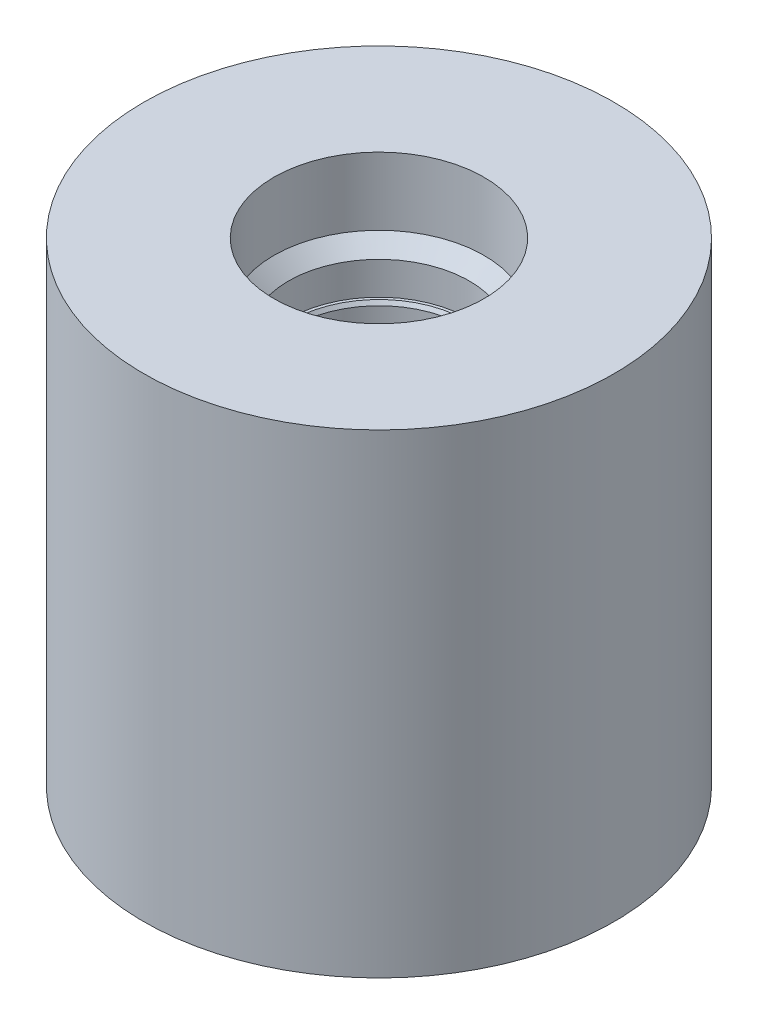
ISO-10303-21;
HEADER;
FILE_DESCRIPTION(('STEP AP214'),'2;1');
FILE_NAME('part.step','',(''),(''),'','','');
FILE_SCHEMA(('AUTOMOTIVE_DESIGN { 1 0 10303 214 1 1 1 1 }'));
ENDSEC;
DATA;
#1=APPLICATION_CONTEXT('core data for automotive mechanical design processes');
#2=APPLICATION_PROTOCOL_DEFINITION('international standard','automotive_design',2000,#1);
#3=PRODUCT_CONTEXT('',#1,'mechanical');
#4=PRODUCT('Part','Part','',(#3));
#5=PRODUCT_RELATED_PRODUCT_CATEGORY('part','',(#4));
#6=PRODUCT_DEFINITION_FORMATION('','',#4);
#7=PRODUCT_DEFINITION_CONTEXT('part definition',#1,'design');
#8=PRODUCT_DEFINITION('design','',#6,#7);
#9=PRODUCT_DEFINITION_SHAPE('','',#8);
#10=(LENGTH_UNIT() NAMED_UNIT(*) SI_UNIT(.MILLI.,.METRE.));
#11=(NAMED_UNIT(*) PLANE_ANGLE_UNIT() SI_UNIT($,.RADIAN.));
#12=(NAMED_UNIT(*) SI_UNIT($,.STERADIAN.) SOLID_ANGLE_UNIT());
#13=UNCERTAINTY_MEASURE_WITH_UNIT(LENGTH_MEASURE(1.E-05),#10,'distance_accuracy_value','');
#14=(GEOMETRIC_REPRESENTATION_CONTEXT(3) GLOBAL_UNCERTAINTY_ASSIGNED_CONTEXT((#13)) GLOBAL_UNIT_ASSIGNED_CONTEXT((#10,
#11,#12)) REPRESENTATION_CONTEXT('',''));
#15=CARTESIAN_POINT('',(0.,0.,0.));
#16=DIRECTION('',(0.,0.,1.));
#17=DIRECTION('',(1.,0.,0.));
#18=AXIS2_PLACEMENT_3D('',#15,#16,#17);
#19=CARTESIAN_POINT('',(12.0466226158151,653.036002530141,0.));
#20=DIRECTION('',(0.,1.,0.));
#21=DIRECTION('',(-1.,0.,0.));
#22=AXIS2_PLACEMENT_3D('',#19,#20,#21);
#23=CYLINDRICAL_SURFACE('',#22,28.3989476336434);
#24=CARTESIAN_POINT('',(12.0466226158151,595.722591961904,0.));
#25=DIRECTION('',(0.,1.,0.));
#26=DIRECTION('',(-1.,0.,0.));
#27=AXIS2_PLACEMENT_3D('',#24,#25,#26);
#28=CIRCLE('',#27,28.3989476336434);
#29=CARTESIAN_POINT('',(-16.3523250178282,595.722591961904,0.));
#30=VERTEX_POINT('',#29);
#31=EDGE_CURVE('E10',#30,#30,#28,.T.);
#32=ORIENTED_EDGE('',*,*,#31,.T.);
#33=EDGE_LOOP('',(#32));
#34=FACE_BOUND('',#33,.T.);
#35=CARTESIAN_POINT('',(12.0466226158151,653.036002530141,0.));
#36=DIRECTION('',(0.,1.,0.));
#37=DIRECTION('',(-1.,0.,0.));
#38=AXIS2_PLACEMENT_3D('',#35,#36,#37);
#39=CIRCLE('',#38,28.3989476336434);
#40=CARTESIAN_POINT('',(-16.3523250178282,653.036002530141,0.));
#41=VERTEX_POINT('',#40);
#42=EDGE_CURVE('E76',#41,#41,#39,.T.);
#43=ORIENTED_EDGE('',*,*,#42,.F.);
#44=EDGE_LOOP('',(#43));
#45=FACE_BOUND('',#44,.T.);
#46=ADVANCED_FACE('F24',(#34,#45),#23,.T.);
#47=CARTESIAN_POINT('',(-16.3523250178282,595.722591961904,0.));
#48=DIRECTION('',(0.,-1.,0.));
#49=DIRECTION('',(1.,0.,0.));
#50=AXIS2_PLACEMENT_3D('',#47,#48,#49);
#51=PLANE('',#50);
#52=CARTESIAN_POINT('',(12.0466226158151,595.722591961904,0.));
#53=DIRECTION('',(0.,1.,0.));
#54=DIRECTION('',(-1.,0.,0.));
#55=AXIS2_PLACEMENT_3D('',#52,#53,#54);
#56=CIRCLE('',#55,6.745);
#57=CARTESIAN_POINT('',(5.30162261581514,595.722591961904,0.));
#58=VERTEX_POINT('',#57);
#59=EDGE_CURVE('E30',#58,#58,#56,.T.);
#60=ORIENTED_EDGE('',*,*,#59,.T.);
#61=EDGE_LOOP('',(#60));
#62=FACE_BOUND('',#61,.T.);
#63=ORIENTED_EDGE('',*,*,#31,.F.);
#64=EDGE_LOOP('',(#63));
#65=FACE_BOUND('',#64,.T.);
#66=ADVANCED_FACE('F84',(#62,#65),#51,.T.);
#67=CARTESIAN_POINT('',(12.0466226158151,653.036002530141,0.));
#68=DIRECTION('',(0.,1.,0.));
#69=DIRECTION('',(-1.,0.,0.));
#70=AXIS2_PLACEMENT_3D('',#67,#68,#69);
#71=CYLINDRICAL_SURFACE('',#70,6.745);
#72=CARTESIAN_POINT('',(12.0466226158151,599.252899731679,0.));
#73=DIRECTION('',(0.,1.,0.));
#74=DIRECTION('',(-1.,0.,0.));
#75=AXIS2_PLACEMENT_3D('',#72,#73,#74);
#76=CIRCLE('',#75,6.745);
#77=CARTESIAN_POINT('',(5.30162261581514,599.252899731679,0.));
#78=VERTEX_POINT('',#77);
#79=EDGE_CURVE('E34',#78,#78,#76,.T.);
#80=ORIENTED_EDGE('',*,*,#79,.T.);
#81=EDGE_LOOP('',(#80));
#82=FACE_BOUND('',#81,.T.);
#83=ORIENTED_EDGE('',*,*,#59,.F.);
#84=EDGE_LOOP('',(#83));
#85=FACE_BOUND('',#84,.T.);
#86=ADVANCED_FACE('F88',(#82,#85),#71,.F.);
#87=CARTESIAN_POINT('',(5.30162261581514,599.252899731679,0.));
#88=DIRECTION('',(0.,1.,0.));
#89=DIRECTION('',(-1.,0.,0.));
#90=AXIS2_PLACEMENT_3D('',#87,#88,#89);
#91=PLANE('',#90);
#92=CARTESIAN_POINT('',(12.0466226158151,599.252899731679,0.));
#93=DIRECTION('',(0.,1.,0.));
#94=DIRECTION('',(-1.,0.,0.));
#95=AXIS2_PLACEMENT_3D('',#92,#93,#94);
#96=CIRCLE('',#95,8.61061782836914);
#97=CARTESIAN_POINT('',(3.436004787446,599.252899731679,0.));
#98=VERTEX_POINT('',#97);
#99=EDGE_CURVE('E38',#98,#98,#96,.T.);
#100=ORIENTED_EDGE('',*,*,#99,.T.);
#101=EDGE_LOOP('',(#100));
#102=FACE_BOUND('',#101,.T.);
#103=ORIENTED_EDGE('',*,*,#79,.F.);
#104=EDGE_LOOP('',(#103));
#105=FACE_BOUND('',#104,.T.);
#106=ADVANCED_FACE('F92',(#102,#105),#91,.T.);
#107=CARTESIAN_POINT('',(12.0466226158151,599.252899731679,0.));
#108=DIRECTION('',(0.,1.,0.));
#109=DIRECTION('',(-1.,0.,0.));
#110=AXIS2_PLACEMENT_3D('',#107,#108,#109);
#111=CONICAL_SURFACE('',#110,8.61061782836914,0.78501662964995);
#112=CARTESIAN_POINT('',(12.0466226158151,599.379926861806,0.));
#113=DIRECTION('',(0.,1.,0.));
#114=DIRECTION('',(-1.,0.,0.));
#115=AXIS2_PLACEMENT_3D('',#112,#113,#114);
#116=CIRCLE('',#115,8.73754806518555);
#117=CARTESIAN_POINT('',(3.3090745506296,599.379926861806,0.));
#118=VERTEX_POINT('',#117);
#119=EDGE_CURVE('E43',#118,#118,#116,.T.);
#120=ORIENTED_EDGE('',*,*,#119,.T.);
#121=EDGE_LOOP('',(#120));
#122=FACE_BOUND('',#121,.T.);
#123=ORIENTED_EDGE('',*,*,#99,.F.);
#124=EDGE_LOOP('',(#123));
#125=FACE_BOUND('',#124,.T.);
#126=ADVANCED_FACE('F99',(#122,#125),#111,.F.);
#127=CARTESIAN_POINT('',(12.0466226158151,653.036002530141,0.));
#128=DIRECTION('',(0.,1.,0.));
#129=DIRECTION('',(-1.,0.,0.));
#130=AXIS2_PLACEMENT_3D('',#127,#128,#129);
#131=CYLINDRICAL_SURFACE('',#130,8.73754806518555);
#132=CARTESIAN_POINT('',(12.0466226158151,606.40309313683,0.));
#133=DIRECTION('',(0.,1.,0.));
#134=DIRECTION('',(-1.,0.,0.));
#135=AXIS2_PLACEMENT_3D('',#132,#133,#134);
#136=CIRCLE('',#135,8.73754806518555);
#137=CARTESIAN_POINT('',(3.3090745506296,606.40309313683,0.));
#138=VERTEX_POINT('',#137);
#139=EDGE_CURVE('E46',#138,#138,#136,.T.);
#140=ORIENTED_EDGE('',*,*,#139,.T.);
#141=EDGE_LOOP('',(#140));
#142=FACE_BOUND('',#141,.T.);
#143=ORIENTED_EDGE('',*,*,#119,.F.);
#144=EDGE_LOOP('',(#143));
#145=FACE_BOUND('',#144,.T.);
#146=ADVANCED_FACE('F103',(#142,#145),#131,.F.);
#147=CARTESIAN_POINT('',(12.0466226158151,606.40309313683,0.));
#148=DIRECTION('',(0.,1.,0.));
#149=DIRECTION('',(-1.,0.,0.));
#150=AXIS2_PLACEMENT_3D('',#147,#148,#149);
#151=CONICAL_SURFACE('',#150,8.73754806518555,0.78548485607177);
#152=CARTESIAN_POINT('',(12.0466226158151,606.961876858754,0.));
#153=DIRECTION('',(0.,1.,0.));
#154=DIRECTION('',(-1.,0.,0.));
#155=AXIS2_PLACEMENT_3D('',#152,#153,#154);
#156=CIRCLE('',#155,9.29642868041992);
#157=CARTESIAN_POINT('',(2.75019393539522,606.961876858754,0.));
#158=VERTEX_POINT('',#157);
#159=EDGE_CURVE('E49',#158,#158,#156,.T.);
#160=ORIENTED_EDGE('',*,*,#159,.T.);
#161=EDGE_LOOP('',(#160));
#162=FACE_BOUND('',#161,.T.);
#163=ORIENTED_EDGE('',*,*,#139,.F.);
#164=EDGE_LOOP('',(#163));
#165=FACE_BOUND('',#164,.T.);
#166=ADVANCED_FACE('F107',(#162,#165),#151,.F.);
#167=CARTESIAN_POINT('',(12.0466226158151,653.036002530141,0.));
#168=DIRECTION('',(0.,1.,0.));
#169=DIRECTION('',(-1.,0.,0.));
#170=AXIS2_PLACEMENT_3D('',#167,#168,#169);
#171=CYLINDRICAL_SURFACE('',#170,9.29642868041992);
#172=CARTESIAN_POINT('',(12.0466226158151,634.139869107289,0.));
#173=DIRECTION('',(0.,1.,0.));
#174=DIRECTION('',(-1.,0.,0.));
#175=AXIS2_PLACEMENT_3D('',#172,#173,#174);
#176=CIRCLE('',#175,9.29642868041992);
#177=CARTESIAN_POINT('',(2.75019393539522,634.139869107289,0.));
#178=VERTEX_POINT('',#177);
#179=EDGE_CURVE('E52',#178,#178,#176,.T.);
#180=ORIENTED_EDGE('',*,*,#179,.T.);
#181=EDGE_LOOP('',(#180));
#182=FACE_BOUND('',#181,.T.);
#183=ORIENTED_EDGE('',*,*,#159,.F.);
#184=EDGE_LOOP('',(#183));
#185=FACE_BOUND('',#184,.T.);
#186=ADVANCED_FACE('F111',(#182,#185),#171,.F.);
#187=CARTESIAN_POINT('',(12.0466226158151,634.139869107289,0.));
#188=DIRECTION('',(0.,1.,0.));
#189=DIRECTION('',(-1.,0.,0.));
#190=AXIS2_PLACEMENT_3D('',#187,#188,#189);
#191=CONICAL_SURFACE('',#190,9.29642868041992,0.785398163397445);
#192=CARTESIAN_POINT('',(12.0466226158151,635.155892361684,0.));
#193=DIRECTION('',(0.,1.,0.));
#194=DIRECTION('',(-1.,0.,0.));
#195=AXIS2_PLACEMENT_3D('',#192,#193,#194);
#196=CIRCLE('',#195,10.3124519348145);
#197=CARTESIAN_POINT('',(1.73417068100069,635.155892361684,0.));
#198=VERTEX_POINT('',#197);
#199=EDGE_CURVE('E55',#198,#198,#196,.T.);
#200=ORIENTED_EDGE('',*,*,#199,.T.);
#201=EDGE_LOOP('',(#200));
#202=FACE_BOUND('',#201,.T.);
#203=ORIENTED_EDGE('',*,*,#179,.F.);
#204=EDGE_LOOP('',(#203));
#205=FACE_BOUND('',#204,.T.);
#206=ADVANCED_FACE('F115',(#202,#205),#191,.F.);
#207=CARTESIAN_POINT('',(12.0466226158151,653.036002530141,0.));
#208=DIRECTION('',(0.,1.,0.));
#209=DIRECTION('',(-1.,0.,0.));
#210=AXIS2_PLACEMENT_3D('',#207,#208,#209);
#211=CYLINDRICAL_SURFACE('',#210,10.3124519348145);
#212=CARTESIAN_POINT('',(12.0466226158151,638.656356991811,0.));
#213=DIRECTION('',(0.,1.,0.));
#214=DIRECTION('',(-1.,0.,0.));
#215=AXIS2_PLACEMENT_3D('',#212,#213,#214);
#216=CIRCLE('',#215,10.3124519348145);
#217=CARTESIAN_POINT('',(1.73417068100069,638.656356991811,0.));
#218=VERTEX_POINT('',#217);
#219=EDGE_CURVE('E58',#218,#218,#216,.T.);
#220=ORIENTED_EDGE('',*,*,#219,.T.);
#221=EDGE_LOOP('',(#220));
#222=FACE_BOUND('',#221,.T.);
#223=ORIENTED_EDGE('',*,*,#199,.F.);
#224=EDGE_LOOP('',(#223));
#225=FACE_BOUND('',#224,.T.);
#226=ADVANCED_FACE('F119',(#222,#225),#211,.F.);
#227=CARTESIAN_POINT('',(12.0466226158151,638.656356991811,0.));
#228=DIRECTION('',(0.,1.,0.));
#229=DIRECTION('',(-1.,0.,0.));
#230=AXIS2_PLACEMENT_3D('',#227,#228,#229);
#231=CONICAL_SURFACE('',#230,10.3124519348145,0.523562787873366);
#232=CARTESIAN_POINT('',(12.0466226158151,639.118247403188,0.));
#233=DIRECTION('',(0.,1.,0.));
#234=DIRECTION('',(-1.,0.,0.));
#235=AXIS2_PLACEMENT_3D('',#232,#233,#234);
#236=CIRCLE('',#235,10.5791023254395);
#237=CARTESIAN_POINT('',(1.46752029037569,639.118247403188,0.));
#238=VERTEX_POINT('',#237);
#239=EDGE_CURVE('E61',#238,#238,#236,.T.);
#240=ORIENTED_EDGE('',*,*,#239,.T.);
#241=EDGE_LOOP('',(#240));
#242=FACE_BOUND('',#241,.T.);
#243=ORIENTED_EDGE('',*,*,#219,.F.);
#244=EDGE_LOOP('',(#243));
#245=FACE_BOUND('',#244,.T.);
#246=ADVANCED_FACE('F123',(#242,#245),#231,.F.);
#247=CARTESIAN_POINT('',(1.1246148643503,639.118247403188,0.));
#248=DIRECTION('',(0.,1.,0.));
#249=DIRECTION('',(-1.,0.,0.));
#250=AXIS2_PLACEMENT_3D('',#247,#248,#249);
#251=PLANE('',#250);
#252=CARTESIAN_POINT('',(12.0466226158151,639.118247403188,0.));
#253=DIRECTION('',(0.,1.,0.));
#254=DIRECTION('',(-1.,0.,0.));
#255=AXIS2_PLACEMENT_3D('',#252,#253,#254);
#256=CIRCLE('',#255,10.9220077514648);
#257=CARTESIAN_POINT('',(1.1246148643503,639.118247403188,0.));
#258=VERTEX_POINT('',#257);
#259=EDGE_CURVE('E64',#258,#258,#256,.T.);
#260=ORIENTED_EDGE('',*,*,#259,.T.);
#261=EDGE_LOOP('',(#260));
#262=FACE_BOUND('',#261,.T.);
#263=ORIENTED_EDGE('',*,*,#239,.F.);
#264=EDGE_LOOP('',(#263));
#265=FACE_BOUND('',#264,.T.);
#266=ADVANCED_FACE('F127',(#262,#265),#251,.T.);
#267=CARTESIAN_POINT('',(12.0466226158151,653.036002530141,0.));
#268=DIRECTION('',(0.,1.,0.));
#269=DIRECTION('',(-1.,0.,0.));
#270=AXIS2_PLACEMENT_3D('',#267,#268,#269);
#271=CYLINDRICAL_SURFACE('',#270,10.9220077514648);
#272=CARTESIAN_POINT('',(12.0466226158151,643.080699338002,0.));
#273=DIRECTION('',(0.,1.,0.));
#274=DIRECTION('',(-1.,0.,0.));
#275=AXIS2_PLACEMENT_3D('',#272,#273,#274);
#276=CIRCLE('',#275,10.9220077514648);
#277=CARTESIAN_POINT('',(1.1246148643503,643.080699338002,0.));
#278=VERTEX_POINT('',#277);
#279=EDGE_CURVE('E67',#278,#278,#276,.T.);
#280=ORIENTED_EDGE('',*,*,#279,.T.);
#281=EDGE_LOOP('',(#280));
#282=FACE_BOUND('',#281,.T.);
#283=ORIENTED_EDGE('',*,*,#259,.F.);
#284=EDGE_LOOP('',(#283));
#285=FACE_BOUND('',#284,.T.);
#286=ADVANCED_FACE('F131',(#282,#285),#271,.F.);
#287=CARTESIAN_POINT('',(12.0466226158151,643.080699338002,0.));
#288=DIRECTION('',(0.,1.,0.));
#289=DIRECTION('',(-1.,0.,0.));
#290=AXIS2_PLACEMENT_3D('',#287,#288,#289);
#291=CONICAL_SURFACE('',#290,10.9220077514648,0.785398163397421);
#292=CARTESIAN_POINT('',(12.0466226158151,644.858691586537,0.));
#293=DIRECTION('',(0.,1.,0.));
#294=DIRECTION('',(-1.,0.,0.));
#295=AXIS2_PLACEMENT_3D('',#292,#293,#294);
#296=CIRCLE('',#295,12.7);
#297=CARTESIAN_POINT('',(-0.653377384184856,644.858691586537,0.));
#298=VERTEX_POINT('',#297);
#299=EDGE_CURVE('E70',#298,#298,#296,.T.);
#300=ORIENTED_EDGE('',*,*,#299,.T.);
#301=EDGE_LOOP('',(#300));
#302=FACE_BOUND('',#301,.T.);
#303=ORIENTED_EDGE('',*,*,#279,.F.);
#304=EDGE_LOOP('',(#303));
#305=FACE_BOUND('',#304,.T.);
#306=ADVANCED_FACE('F135',(#302,#305),#291,.F.);
#307=CARTESIAN_POINT('',(12.0466226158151,653.036002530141,0.));
#308=DIRECTION('',(0.,1.,0.));
#309=DIRECTION('',(-1.,0.,0.));
#310=AXIS2_PLACEMENT_3D('',#307,#308,#309);
#311=CYLINDRICAL_SURFACE('',#310,12.7);
#312=CARTESIAN_POINT('',(12.0466226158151,653.036002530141,0.));
#313=DIRECTION('',(0.,1.,0.));
#314=DIRECTION('',(-1.,0.,0.));
#315=AXIS2_PLACEMENT_3D('',#312,#313,#314);
#316=CIRCLE('',#315,12.7);
#317=CARTESIAN_POINT('',(-0.653377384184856,653.036002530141,0.));
#318=VERTEX_POINT('',#317);
#319=EDGE_CURVE('E73',#318,#318,#316,.T.);
#320=ORIENTED_EDGE('',*,*,#319,.T.);
#321=EDGE_LOOP('',(#320));
#322=FACE_BOUND('',#321,.T.);
#323=ORIENTED_EDGE('',*,*,#299,.F.);
#324=EDGE_LOOP('',(#323));
#325=FACE_BOUND('',#324,.T.);
#326=ADVANCED_FACE('F139',(#322,#325),#311,.F.);
#327=CARTESIAN_POINT('',(-0.653377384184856,653.036002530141,0.));
#328=DIRECTION('',(0.,1.,0.));
#329=DIRECTION('',(-1.,0.,0.));
#330=AXIS2_PLACEMENT_3D('',#327,#328,#329);
#331=PLANE('',#330);
#332=ORIENTED_EDGE('',*,*,#42,.T.);
#333=EDGE_LOOP('',(#332));
#334=FACE_BOUND('',#333,.T.);
#335=ORIENTED_EDGE('',*,*,#319,.F.);
#336=EDGE_LOOP('',(#335));
#337=FACE_BOUND('',#336,.T.);
#338=ADVANCED_FACE('F80',(#334,#337),#331,.T.);
#339=CLOSED_SHELL('',(#46,#66,#86,#106,#126,#146,#166,#186,#206,#226,#246,#266,#286,#306,#326,#338));
#340=MANIFOLD_SOLID_BREP('B2',#339);
#341=ADVANCED_BREP_SHAPE_REPRESENTATION('',(#18,#340),#14);
#342=SHAPE_DEFINITION_REPRESENTATION(#9,#341);
ENDSEC;
END-ISO-10303-21;
